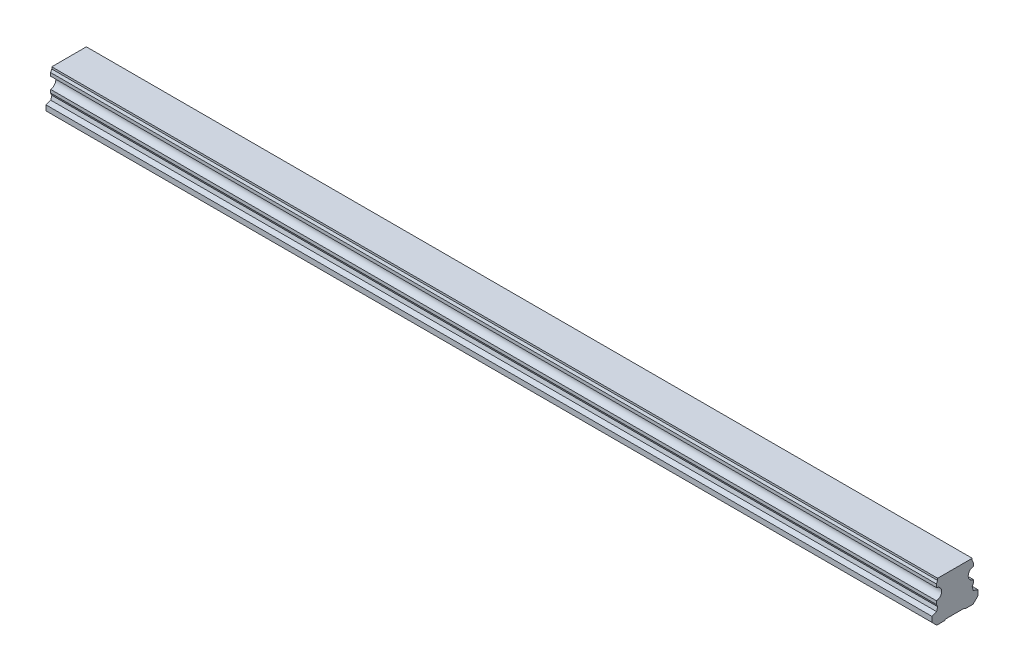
from build123d import *

# Parameters (mm, degrees)
BOSS_EXTRUDE1_DEPTH        = 480
SKETCH3_R                  = 3
SKETCH3_R_2                = 2.5
CUT_EXTRUDE3_DEPTH         = 12
SKETCH3_2_R                = 2.5
CUT_EXTRUDE4_DEPTH         = 15
CHAMFER1_SIZE              = 0.5
LPATTERN4_COUNT            = 8
LPATTERN4_PITCH            = 60
CHAMFER1_OF_LPATTERN4_SIZE = 0.5


with BuildPart() as part:
    # Sketch1 → Boss-Extrude1 (new body)
    with BuildSketch(Plane(origin=(0, 0, 0), x_dir=(0, 0, -1), z_dir=(1, 0, 0))):
        with BuildLine():
            Line((9.375, 21.8), (-9.375, 21.8))
            Line((-9.375, 21.8), (-9.375, 20.756))
            Line((-9.375, 20.756), (-10, 19.415683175))
            Line((-10, 19.415683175), (-10, 17.685449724))
            ThreePointArc((-10, 17.685449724), (-7.2, 14.6), (-10, 11.514550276))
            Line((-10, 11.514550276), (-10, 9.784316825))
            Line((-10, 9.784316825), (-9.375, 8.444))
            Line((-9.375, 8.444), (-9.922688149, 6.4))
            Line((-9.922688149, 6.4), (-12.5, 5.489338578))
            Line((-12.5, 5.489338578), (-12.5, 2.65))
            Line((-12.5, 2.65), (-9.85, 0))
            Line((-9.85, 0), (-5.5, 0))
            Line((-5.5, 0), (-5, 0.5))
            Line((-5, 0.5), (5, 0.5))
            Line((5, 0.5), (5.5, 0))
            Line((5.5, 0), (9.85, 0))
            Line((9.85, 0), (12.5, 2.65))
            Line((12.5, 2.65), (12.5, 5.489338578))
            Line((12.5, 5.489338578), (9.922688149, 6.4))
            Line((9.922688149, 6.4), (9.375, 8.444))
            Line((9.375, 8.444), (10, 9.784316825))
            Line((10, 9.784316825), (10, 11.514550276))
            ThreePointArc((10, 11.514550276), (7.2, 14.6), (10, 17.685449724))
            Line((10, 17.685449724), (10, 19.415683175))
            Line((10, 19.415683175), (9.375, 20.756))
            Line((9.375, 20.756), (9.375, 21.8))
        make_face()
    extrude(amount=BOSS_EXTRUDE1_DEPTH)

    # Sketch3 → Cut-Extrude3 (cut)
    with BuildSketch(Plane.XZ):
        with Locations(Location((30, 0, 0), (0, 0, 270))):
            Circle(SKETCH3_R)
        with Locations(Location((30, 0, 0), (0, 0, 270))):
            Circle(SKETCH3_R_2, mode=Mode.SUBTRACT)
    cut_extrude3 = extrude(amount=-CUT_EXTRUDE3_DEPTH, mode=Mode.SUBTRACT)

    # Sketch3_2 → Cut-Extrude4 (cut)
    with BuildSketch(Plane.XZ):
        with Locations(Location((30, 0, 0), (0, 0, 270))):
            Circle(SKETCH3_2_R)
    cut_extrude4 = extrude(amount=-CUT_EXTRUDE4_DEPTH, mode=Mode.SUBTRACT)

    # Cut-Extrude5 cone 1 section (on through the dimple's axis) → Cut-Extrude5 (revolve, cut)
    with BuildSketch(Plane(origin=(30, 15, 0), x_dir=(0, 0, -1), z_dir=(1, 0, 0))):
        Polygon((0, 0), (2.5, 0), (0, 1.443375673), align=None)
    cut_extrude5 = revolve(axis=Axis((30, 15, 0), (0, 1, 0)), mode=Mode.SUBTRACT)

    # Chamfer1
    chamfer1_edges = [part.edges().sort_by_distance(p)[0] for p in [
        (30, 0.5, 3),
    ]]
    chamfer(chamfer1_edges, length=CHAMFER1_SIZE)

    # LPattern4: Cut-Extrude3, Cut-Extrude4, Cut-Extrude5 ×8
    with Locations(*[(i * LPATTERN4_PITCH, 0, 0) for i in range(1, LPATTERN4_COUNT)]):
        add(cut_extrude3, mode=Mode.SUBTRACT)
        add(cut_extrude4, mode=Mode.SUBTRACT)
        add(cut_extrude5, mode=Mode.SUBTRACT)

    # Chamfer1 of LPattern4
    chamfer1_of_lpattern4_edges = [part.edges().sort_by_distance(p)[0] for p in [
        (90, 0.5, 3),
        (150, 0.5, 3),
        (210, 0.5, 3),
        (270, 0.5, 3),
        (330, 0.5, 3),
        (390, 0.5, 3),
        (450, 0.5, 3),
    ]]
    chamfer(chamfer1_of_lpattern4_edges, length=CHAMFER1_OF_LPATTERN4_SIZE)


solid = part.part
